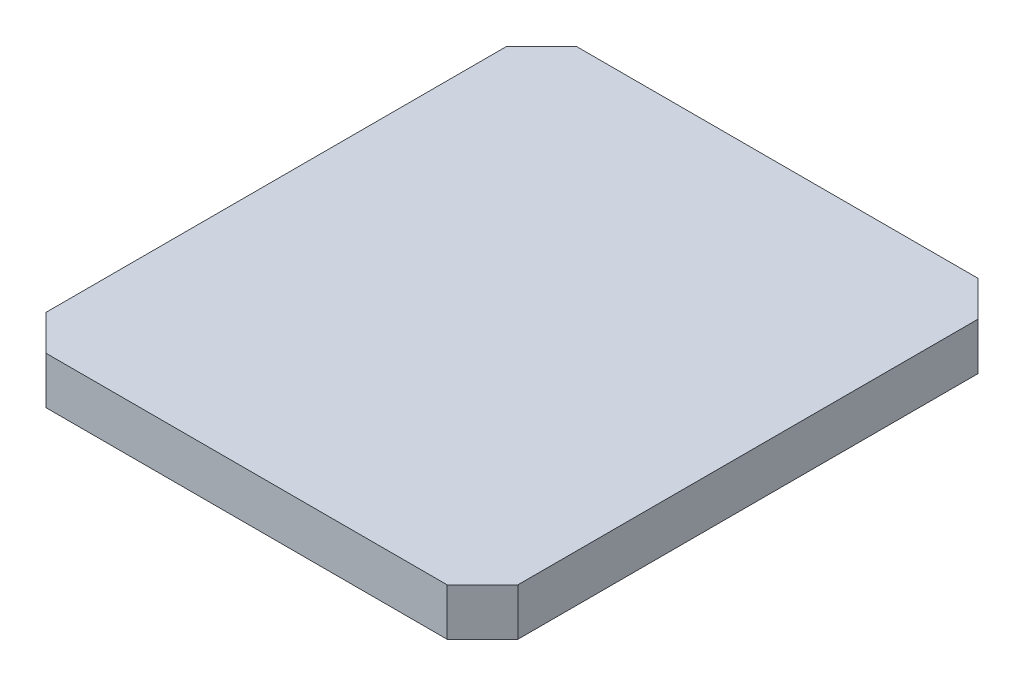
ISO-10303-21;
HEADER;
FILE_DESCRIPTION(('STEP AP214'),'2;1');
FILE_NAME('part.step','',(''),(''),'','','');
FILE_SCHEMA(('AUTOMOTIVE_DESIGN { 1 0 10303 214 1 1 1 1 }'));
ENDSEC;
DATA;
#1=APPLICATION_CONTEXT('core data for automotive mechanical design processes');
#2=APPLICATION_PROTOCOL_DEFINITION('international standard','automotive_design',2000,#1);
#3=PRODUCT_CONTEXT('',#1,'mechanical');
#4=PRODUCT('Part','Part','',(#3));
#5=PRODUCT_RELATED_PRODUCT_CATEGORY('part','',(#4));
#6=PRODUCT_DEFINITION_FORMATION('','',#4);
#7=PRODUCT_DEFINITION_CONTEXT('part definition',#1,'design');
#8=PRODUCT_DEFINITION('design','',#6,#7);
#9=PRODUCT_DEFINITION_SHAPE('','',#8);
#10=(LENGTH_UNIT() NAMED_UNIT(*) SI_UNIT(.MILLI.,.METRE.));
#11=(NAMED_UNIT(*) PLANE_ANGLE_UNIT() SI_UNIT($,.RADIAN.));
#12=(NAMED_UNIT(*) SI_UNIT($,.STERADIAN.) SOLID_ANGLE_UNIT());
#13=UNCERTAINTY_MEASURE_WITH_UNIT(LENGTH_MEASURE(1.E-05),#10,'distance_accuracy_value','');
#14=(GEOMETRIC_REPRESENTATION_CONTEXT(3) GLOBAL_UNCERTAINTY_ASSIGNED_CONTEXT((#13)) GLOBAL_UNIT_ASSIGNED_CONTEXT((#10,
#11,#12)) REPRESENTATION_CONTEXT('',''));
#15=CARTESIAN_POINT('',(0.,0.,0.));
#16=DIRECTION('',(0.,0.,1.));
#17=DIRECTION('',(1.,0.,0.));
#18=AXIS2_PLACEMENT_3D('',#15,#16,#17);
#19=CARTESIAN_POINT('',(0.,101.6,0.));
#20=DIRECTION('',(0.,-1.,0.));
#21=DIRECTION('',(0.,0.,-1.));
#22=AXIS2_PLACEMENT_3D('',#19,#20,#21);
#23=PLANE('',#22);
#24=DIRECTION('',(-0.707106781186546,0.,0.707106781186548));
#25=VECTOR('',#24,1.);
#26=CARTESIAN_POINT('',(508.,101.6,495.3));
#27=LINE('',#26,#25);
#28=CARTESIAN_POINT('',(508.,101.6,495.3));
#29=VERTEX_POINT('',#28);
#30=CARTESIAN_POINT('',(431.8,101.6,571.5));
#31=VERTEX_POINT('',#30);
#32=EDGE_CURVE('E65',#29,#31,#27,.T.);
#33=ORIENTED_EDGE('',*,*,#32,.F.);
#34=DIRECTION('',(0.,0.,-1.));
#35=VECTOR('',#34,1.);
#36=CARTESIAN_POINT('',(508.,101.6,571.5));
#37=LINE('',#36,#35);
#38=CARTESIAN_POINT('',(508.,101.6,-495.3));
#39=VERTEX_POINT('',#38);
#40=EDGE_CURVE('E126',#29,#39,#37,.T.);
#41=ORIENTED_EDGE('',*,*,#40,.T.);
#42=DIRECTION('',(-0.707106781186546,0.,-0.707106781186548));
#43=VECTOR('',#42,1.);
#44=CARTESIAN_POINT('',(508.,101.6,-495.3));
#45=LINE('',#44,#43);
#46=CARTESIAN_POINT('',(431.8,101.6,-571.5));
#47=VERTEX_POINT('',#46);
#48=EDGE_CURVE('E174',#39,#47,#45,.T.);
#49=ORIENTED_EDGE('',*,*,#48,.T.);
#50=DIRECTION('',(-1.,0.,0.));
#51=VECTOR('',#50,1.);
#52=CARTESIAN_POINT('',(-508.,101.6,-571.5));
#53=LINE('',#52,#51);
#54=CARTESIAN_POINT('',(-431.8,101.6,-571.5));
#55=VERTEX_POINT('',#54);
#56=EDGE_CURVE('E136',#47,#55,#53,.T.);
#57=ORIENTED_EDGE('',*,*,#56,.T.);
#58=DIRECTION('',(0.707106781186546,0.,-0.707106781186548));
#59=VECTOR('',#58,1.);
#60=CARTESIAN_POINT('',(-508.,101.6,-495.3));
#61=LINE('',#60,#59);
#62=CARTESIAN_POINT('',(-508.,101.6,-495.3));
#63=VERTEX_POINT('',#62);
#64=EDGE_CURVE('E192',#63,#55,#61,.T.);
#65=ORIENTED_EDGE('',*,*,#64,.F.);
#66=DIRECTION('',(0.,0.,1.));
#67=VECTOR('',#66,1.);
#68=CARTESIAN_POINT('',(-508.,101.6,571.5));
#69=LINE('',#68,#67);
#70=CARTESIAN_POINT('',(-508.,101.6,495.3));
#71=VERTEX_POINT('',#70);
#72=EDGE_CURVE('E141',#63,#71,#69,.T.);
#73=ORIENTED_EDGE('',*,*,#72,.T.);
#74=DIRECTION('',(0.707106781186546,0.,0.707106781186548));
#75=VECTOR('',#74,1.);
#76=CARTESIAN_POINT('',(-508.,101.6,495.3));
#77=LINE('',#76,#75);
#78=CARTESIAN_POINT('',(-431.8,101.6,571.5));
#79=VERTEX_POINT('',#78);
#80=EDGE_CURVE('E209',#71,#79,#77,.T.);
#81=ORIENTED_EDGE('',*,*,#80,.T.);
#82=DIRECTION('',(1.,0.,0.));
#83=VECTOR('',#82,1.);
#84=CARTESIAN_POINT('',(-508.,101.6,571.5));
#85=LINE('',#84,#83);
#86=EDGE_CURVE('E58',#79,#31,#85,.T.);
#87=ORIENTED_EDGE('',*,*,#86,.T.);
#88=EDGE_LOOP('',(#33,#41,#49,#57,#65,#73,#81,#87));
#89=FACE_BOUND('',#88,.T.);
#90=ADVANCED_FACE('F49',(#89),#23,.F.);
#91=CARTESIAN_POINT('',(0.,0.,0.));
#92=DIRECTION('',(0.,-1.,0.));
#93=DIRECTION('',(0.,0.,-1.));
#94=AXIS2_PLACEMENT_3D('',#91,#92,#93);
#95=PLANE('',#94);
#96=DIRECTION('',(0.,0.,-1.));
#97=VECTOR('',#96,1.);
#98=CARTESIAN_POINT('',(508.,0.,571.5));
#99=LINE('',#98,#97);
#100=CARTESIAN_POINT('',(508.,0.,495.3));
#101=VERTEX_POINT('',#100);
#102=CARTESIAN_POINT('',(508.,0.,-495.3));
#103=VERTEX_POINT('',#102);
#104=EDGE_CURVE('E154',#101,#103,#99,.T.);
#105=ORIENTED_EDGE('',*,*,#104,.F.);
#106=DIRECTION('',(-0.707106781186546,0.,0.707106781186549));
#107=VECTOR('',#106,1.);
#108=CARTESIAN_POINT('',(501.650000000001,0.,501.649999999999));
#109=LINE('',#108,#107);
#110=CARTESIAN_POINT('',(431.8,0.,571.5));
#111=VERTEX_POINT('',#110);
#112=EDGE_CURVE('E116',#101,#111,#109,.T.);
#113=ORIENTED_EDGE('',*,*,#112,.T.);
#114=DIRECTION('',(1.,0.,0.));
#115=VECTOR('',#114,1.);
#116=CARTESIAN_POINT('',(-508.,0.,571.5));
#117=LINE('',#116,#115);
#118=CARTESIAN_POINT('',(-431.8,0.,571.5));
#119=VERTEX_POINT('',#118);
#120=EDGE_CURVE('E137',#119,#111,#117,.T.);
#121=ORIENTED_EDGE('',*,*,#120,.F.);
#122=DIRECTION('',(0.707106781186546,0.,0.707106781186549));
#123=VECTOR('',#122,1.);
#124=CARTESIAN_POINT('',(-501.650000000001,0.,501.649999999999));
#125=LINE('',#124,#123);
#126=CARTESIAN_POINT('',(-508.,0.,495.3));
#127=VERTEX_POINT('',#126);
#128=EDGE_CURVE('E73',#127,#119,#125,.T.);
#129=ORIENTED_EDGE('',*,*,#128,.F.);
#130=DIRECTION('',(0.,0.,1.));
#131=VECTOR('',#130,1.);
#132=CARTESIAN_POINT('',(-508.,0.,571.5));
#133=LINE('',#132,#131);
#134=CARTESIAN_POINT('',(-508.,0.,-495.3));
#135=VERTEX_POINT('',#134);
#136=EDGE_CURVE('E144',#135,#127,#133,.T.);
#137=ORIENTED_EDGE('',*,*,#136,.F.);
#138=DIRECTION('',(0.707106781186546,0.,-0.707106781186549));
#139=VECTOR('',#138,1.);
#140=CARTESIAN_POINT('',(-501.650000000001,0.,-501.649999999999));
#141=LINE('',#140,#139);
#142=CARTESIAN_POINT('',(-431.8,0.,-571.5));
#143=VERTEX_POINT('',#142);
#144=EDGE_CURVE('E11',#135,#143,#141,.T.);
#145=ORIENTED_EDGE('',*,*,#144,.T.);
#146=DIRECTION('',(-1.,0.,0.));
#147=VECTOR('',#146,1.);
#148=CARTESIAN_POINT('',(-508.,0.,-571.5));
#149=LINE('',#148,#147);
#150=CARTESIAN_POINT('',(431.8,0.,-571.5));
#151=VERTEX_POINT('',#150);
#152=EDGE_CURVE('E157',#151,#143,#149,.T.);
#153=ORIENTED_EDGE('',*,*,#152,.F.);
#154=DIRECTION('',(-0.707106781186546,0.,-0.707106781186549));
#155=VECTOR('',#154,1.);
#156=CARTESIAN_POINT('',(501.650000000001,0.,-501.649999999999));
#157=LINE('',#156,#155);
#158=EDGE_CURVE('E189',#103,#151,#157,.T.);
#159=ORIENTED_EDGE('',*,*,#158,.F.);
#160=EDGE_LOOP('',(#105,#113,#121,#129,#137,#145,#153,#159));
#161=FACE_BOUND('',#160,.T.);
#162=ADVANCED_FACE('F170',(#161),#95,.T.);
#163=CARTESIAN_POINT('',(508.,101.6,571.5));
#164=DIRECTION('',(-1.,0.,0.));
#165=DIRECTION('',(0.,0.,1.));
#166=AXIS2_PLACEMENT_3D('',#163,#164,#165);
#167=PLANE('',#166);
#168=DIRECTION('',(0.,-1.,0.));
#169=VECTOR('',#168,1.);
#170=CARTESIAN_POINT('',(508.,101.6,495.3));
#171=LINE('',#170,#169);
#172=EDGE_CURVE('E113',#29,#101,#171,.T.);
#173=ORIENTED_EDGE('',*,*,#172,.T.);
#174=ORIENTED_EDGE('',*,*,#104,.T.);
#175=DIRECTION('',(0.,-1.,0.));
#176=VECTOR('',#175,1.);
#177=CARTESIAN_POINT('',(508.,101.6,-495.3));
#178=LINE('',#177,#176);
#179=EDGE_CURVE('E134',#39,#103,#178,.T.);
#180=ORIENTED_EDGE('',*,*,#179,.F.);
#181=ORIENTED_EDGE('',*,*,#40,.F.);
#182=EDGE_LOOP('',(#173,#174,#180,#181));
#183=FACE_BOUND('',#182,.T.);
#184=ADVANCED_FACE('F51',(#183),#167,.F.);
#185=CARTESIAN_POINT('',(-508.,101.6,571.5));
#186=DIRECTION('',(0.,0.,-1.));
#187=DIRECTION('',(-1.,0.,0.));
#188=AXIS2_PLACEMENT_3D('',#185,#186,#187);
#189=PLANE('',#188);
#190=DIRECTION('',(0.,-1.,0.));
#191=VECTOR('',#190,1.);
#192=CARTESIAN_POINT('',(431.8,101.6,571.5));
#193=LINE('',#192,#191);
#194=EDGE_CURVE('E121',#31,#111,#193,.T.);
#195=ORIENTED_EDGE('',*,*,#194,.F.);
#196=ORIENTED_EDGE('',*,*,#86,.F.);
#197=DIRECTION('',(0.,-1.,0.));
#198=VECTOR('',#197,1.);
#199=CARTESIAN_POINT('',(-431.8,101.6,571.5));
#200=LINE('',#199,#198);
#201=EDGE_CURVE('E175',#79,#119,#200,.T.);
#202=ORIENTED_EDGE('',*,*,#201,.T.);
#203=ORIENTED_EDGE('',*,*,#120,.T.);
#204=EDGE_LOOP('',(#195,#196,#202,#203));
#205=FACE_BOUND('',#204,.T.);
#206=ADVANCED_FACE('F213',(#205),#189,.F.);
#207=CARTESIAN_POINT('',(-508.,101.6,-571.5));
#208=DIRECTION('',(0.,0.,1.));
#209=DIRECTION('',(1.,0.,0.));
#210=AXIS2_PLACEMENT_3D('',#207,#208,#209);
#211=PLANE('',#210);
#212=ORIENTED_EDGE('',*,*,#56,.F.);
#213=DIRECTION('',(0.,-1.,0.));
#214=VECTOR('',#213,1.);
#215=CARTESIAN_POINT('',(431.8,101.6,-571.5));
#216=LINE('',#215,#214);
#217=EDGE_CURVE('E185',#47,#151,#216,.T.);
#218=ORIENTED_EDGE('',*,*,#217,.T.);
#219=ORIENTED_EDGE('',*,*,#152,.T.);
#220=DIRECTION('',(0.,-1.,0.));
#221=VECTOR('',#220,1.);
#222=CARTESIAN_POINT('',(-431.8,101.6,-571.5));
#223=LINE('',#222,#221);
#224=EDGE_CURVE('E195',#55,#143,#223,.T.);
#225=ORIENTED_EDGE('',*,*,#224,.F.);
#226=EDGE_LOOP('',(#212,#218,#219,#225));
#227=FACE_BOUND('',#226,.T.);
#228=ADVANCED_FACE('F205',(#227),#211,.F.);
#229=CARTESIAN_POINT('',(-508.,101.6,571.5));
#230=DIRECTION('',(1.,0.,0.));
#231=DIRECTION('',(0.,0.,-1.));
#232=AXIS2_PLACEMENT_3D('',#229,#230,#231);
#233=PLANE('',#232);
#234=ORIENTED_EDGE('',*,*,#136,.T.);
#235=DIRECTION('',(0.,-1.,0.));
#236=VECTOR('',#235,1.);
#237=CARTESIAN_POINT('',(-508.,101.6,495.3));
#238=LINE('',#237,#236);
#239=EDGE_CURVE('E168',#71,#127,#238,.T.);
#240=ORIENTED_EDGE('',*,*,#239,.F.);
#241=ORIENTED_EDGE('',*,*,#72,.F.);
#242=DIRECTION('',(0.,-1.,0.));
#243=VECTOR('',#242,1.);
#244=CARTESIAN_POINT('',(-508.,101.6,-495.3));
#245=LINE('',#244,#243);
#246=EDGE_CURVE('E146',#63,#135,#245,.T.);
#247=ORIENTED_EDGE('',*,*,#246,.T.);
#248=EDGE_LOOP('',(#234,#240,#241,#247));
#249=FACE_BOUND('',#248,.T.);
#250=ADVANCED_FACE('F166',(#249),#233,.F.);
#251=CARTESIAN_POINT('',(-508.,101.6,-495.3));
#252=DIRECTION('',(-0.707106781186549,0.,-0.707106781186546));
#253=DIRECTION('',(-0.707106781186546,0.,0.707106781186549));
#254=AXIS2_PLACEMENT_3D('',#251,#252,#253);
#255=PLANE('',#254);
#256=ORIENTED_EDGE('',*,*,#246,.F.);
#257=ORIENTED_EDGE('',*,*,#64,.T.);
#258=ORIENTED_EDGE('',*,*,#224,.T.);
#259=ORIENTED_EDGE('',*,*,#144,.F.);
#260=EDGE_LOOP('',(#256,#257,#258,#259));
#261=FACE_BOUND('',#260,.T.);
#262=ADVANCED_FACE('F201',(#261),#255,.T.);
#263=CARTESIAN_POINT('',(508.,101.6,-495.3));
#264=DIRECTION('',(-0.707106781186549,0.,0.707106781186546));
#265=DIRECTION('',(0.707106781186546,0.,0.707106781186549));
#266=AXIS2_PLACEMENT_3D('',#263,#264,#265);
#267=PLANE('',#266);
#268=ORIENTED_EDGE('',*,*,#158,.T.);
#269=ORIENTED_EDGE('',*,*,#217,.F.);
#270=ORIENTED_EDGE('',*,*,#48,.F.);
#271=ORIENTED_EDGE('',*,*,#179,.T.);
#272=EDGE_LOOP('',(#268,#269,#270,#271));
#273=FACE_BOUND('',#272,.T.);
#274=ADVANCED_FACE('F208',(#273),#267,.F.);
#275=CARTESIAN_POINT('',(-508.,101.6,495.3));
#276=DIRECTION('',(0.707106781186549,0.,-0.707106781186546));
#277=DIRECTION('',(-0.707106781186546,0.,-0.707106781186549));
#278=AXIS2_PLACEMENT_3D('',#275,#276,#277);
#279=PLANE('',#278);
#280=ORIENTED_EDGE('',*,*,#128,.T.);
#281=ORIENTED_EDGE('',*,*,#201,.F.);
#282=ORIENTED_EDGE('',*,*,#80,.F.);
#283=ORIENTED_EDGE('',*,*,#239,.T.);
#284=EDGE_LOOP('',(#280,#281,#282,#283));
#285=FACE_BOUND('',#284,.T.);
#286=ADVANCED_FACE('F219',(#285),#279,.F.);
#287=CARTESIAN_POINT('',(508.,101.6,495.3));
#288=DIRECTION('',(0.707106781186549,0.,0.707106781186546));
#289=DIRECTION('',(0.707106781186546,0.,-0.707106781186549));
#290=AXIS2_PLACEMENT_3D('',#287,#288,#289);
#291=PLANE('',#290);
#292=ORIENTED_EDGE('',*,*,#172,.F.);
#293=ORIENTED_EDGE('',*,*,#32,.T.);
#294=ORIENTED_EDGE('',*,*,#194,.T.);
#295=ORIENTED_EDGE('',*,*,#112,.F.);
#296=EDGE_LOOP('',(#292,#293,#294,#295));
#297=FACE_BOUND('',#296,.T.);
#298=ADVANCED_FACE('F114',(#297),#291,.T.);
#299=CLOSED_SHELL('',(#90,#162,#184,#206,#228,#250,#262,#274,#286,#298));
#300=MANIFOLD_SOLID_BREP('B2',#299);
#301=ADVANCED_BREP_SHAPE_REPRESENTATION('',(#18,#300),#14);
#302=SHAPE_DEFINITION_REPRESENTATION(#9,#301);
ENDSEC;
END-ISO-10303-21;
